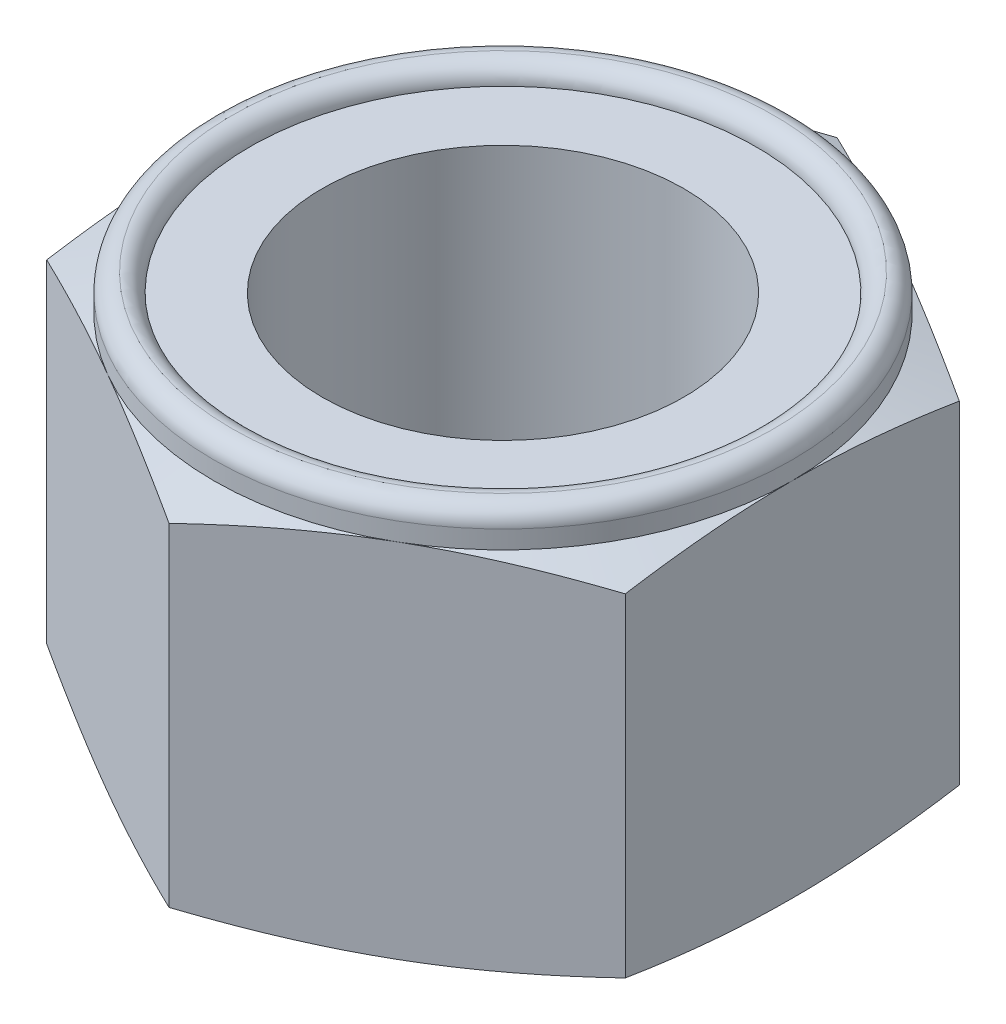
ISO-10303-21;
HEADER;
FILE_DESCRIPTION(('STEP AP214'),'2;1');
FILE_NAME('part.step','',(''),(''),'','','');
FILE_SCHEMA(('AUTOMOTIVE_DESIGN { 1 0 10303 214 1 1 1 1 }'));
ENDSEC;
DATA;
#1=APPLICATION_CONTEXT('core data for automotive mechanical design processes');
#2=APPLICATION_PROTOCOL_DEFINITION('international standard','automotive_design',2000,#1);
#3=PRODUCT_CONTEXT('',#1,'mechanical');
#4=PRODUCT('Part','Part','',(#3));
#5=PRODUCT_RELATED_PRODUCT_CATEGORY('part','',(#4));
#6=PRODUCT_DEFINITION_FORMATION('','',#4);
#7=PRODUCT_DEFINITION_CONTEXT('part definition',#1,'design');
#8=PRODUCT_DEFINITION('design','',#6,#7);
#9=PRODUCT_DEFINITION_SHAPE('','',#8);
#10=(LENGTH_UNIT() NAMED_UNIT(*) SI_UNIT(.MILLI.,.METRE.));
#11=(NAMED_UNIT(*) PLANE_ANGLE_UNIT() SI_UNIT($,.RADIAN.));
#12=(NAMED_UNIT(*) SI_UNIT($,.STERADIAN.) SOLID_ANGLE_UNIT());
#13=UNCERTAINTY_MEASURE_WITH_UNIT(LENGTH_MEASURE(1.E-05),#10,'distance_accuracy_value','');
#14=(GEOMETRIC_REPRESENTATION_CONTEXT(3) GLOBAL_UNCERTAINTY_ASSIGNED_CONTEXT((#13)) GLOBAL_UNIT_ASSIGNED_CONTEXT((#10,
#11,#12)) REPRESENTATION_CONTEXT('',''));
#15=CARTESIAN_POINT('',(0.,0.,0.));
#16=DIRECTION('',(0.,0.,1.));
#17=DIRECTION('',(1.,0.,0.));
#18=AXIS2_PLACEMENT_3D('',#15,#16,#17);
#19=CARTESIAN_POINT('',(0.,0.,0.));
#20=DIRECTION('',(0.,1.,0.));
#21=DIRECTION('',(0.,0.,1.));
#22=AXIS2_PLACEMENT_3D('',#19,#20,#21);
#23=CYLINDRICAL_SURFACE('',#22,3.96875);
#24=CARTESIAN_POINT('',(0.,0.,0.));
#25=DIRECTION('',(0.,1.,0.));
#26=DIRECTION('',(0.,0.,1.));
#27=AXIS2_PLACEMENT_3D('',#24,#25,#26);
#28=CIRCLE('',#27,3.96875);
#29=CARTESIAN_POINT('',(0.,0.,3.96875));
#30=VERTEX_POINT('',#29);
#31=EDGE_CURVE('E256',#30,#30,#28,.T.);
#32=ORIENTED_EDGE('',*,*,#31,.F.);
#33=EDGE_LOOP('',(#32));
#34=FACE_BOUND('',#33,.T.);
#35=CARTESIAN_POINT('',(0.,8.334375,0.));
#36=DIRECTION('',(0.,1.,0.));
#37=DIRECTION('',(0.,0.,1.));
#38=AXIS2_PLACEMENT_3D('',#35,#36,#37);
#39=CIRCLE('',#38,3.96875);
#40=CARTESIAN_POINT('',(0.,8.334375,3.96875));
#41=VERTEX_POINT('',#40);
#42=EDGE_CURVE('E166',#41,#41,#39,.F.);
#43=ORIENTED_EDGE('',*,*,#42,.F.);
#44=EDGE_LOOP('',(#43));
#45=FACE_BOUND('',#44,.T.);
#46=ADVANCED_FACE('F34',(#34,#45),#23,.F.);
#47=CARTESIAN_POINT('',(6.35,7.9375,-3.66617420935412));
#48=DIRECTION('',(-0.5,0.,0.866025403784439));
#49=DIRECTION('',(0.866025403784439,0.,0.5));
#50=AXIS2_PLACEMENT_3D('',#47,#48,#49);
#51=PLANE('',#50);
#52=CARTESIAN_POINT('',(-0.000199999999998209,0.317537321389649,-7.33246388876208));
#53=CARTESIAN_POINT('',(0.263120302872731,0.26838143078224,-7.18043584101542));
#54=CARTESIAN_POINT('',(0.527129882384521,0.223707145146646,-7.02800983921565));
#55=CARTESIAN_POINT('',(1.05650402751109,0.145159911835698,-6.7223755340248));
#56=CARTESIAN_POINT('',(1.3218693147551,0.111293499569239,-6.56916681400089));
#57=CARTESIAN_POINT('',(1.85162405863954,0.0564698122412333,-6.26331277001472));
#58=CARTESIAN_POINT('',(2.11600596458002,0.0354178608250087,-6.11067180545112));
#59=CARTESIAN_POINT('',(2.6452586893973,0.00718496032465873,-5.80510760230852));
#60=CARTESIAN_POINT('',(2.91012934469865,0.,-5.65218445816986));
#61=CARTESIAN_POINT('',(3.43987065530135,0.,-5.34633816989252));
#62=CARTESIAN_POINT('',(3.7047413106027,0.00718496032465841,-5.19341502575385));
#63=CARTESIAN_POINT('',(4.23399403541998,0.0354178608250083,-4.88785082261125));
#64=CARTESIAN_POINT('',(4.49837594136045,0.0564698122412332,-4.73520985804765));
#65=CARTESIAN_POINT('',(5.0281306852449,0.111293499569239,-4.42935581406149));
#66=CARTESIAN_POINT('',(5.29349597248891,0.145159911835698,-4.27614709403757));
#67=CARTESIAN_POINT('',(5.82287011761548,0.223707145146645,-3.97051278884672));
#68=CARTESIAN_POINT('',(6.08687969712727,0.26838143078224,-3.81808678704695));
#69=CARTESIAN_POINT('',(6.3502,0.317537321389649,-3.66605873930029));
#70=B_SPLINE_CURVE_WITH_KNOTS('',3,(#52,#53,#54,#55,#56,#57,#58,#59,#60,#61,#62,#63,#64,#65,#66,
#67,#68,#69),.UNSPECIFIED.,.F.,.F.,(4,2,2,2,2,2,2,2,4),(0.,0.924084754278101,1.84872723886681,
2.76645258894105,3.68391243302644,4.60137227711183,5.51909762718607,6.44374011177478,
7.36782486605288),.UNSPECIFIED.);
#71=CARTESIAN_POINT('',(0.,0.3175,-7.33234841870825));
#72=VERTEX_POINT('',#71);
#73=CARTESIAN_POINT('',(3.175,0.,-5.49926131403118));
#74=VERTEX_POINT('',#73);
#75=EDGE_CURVE('E126',#72,#74,#70,.T.);
#76=ORIENTED_EDGE('',*,*,#75,.F.);
#77=DIRECTION('',(0.,-1.,0.));
#78=VECTOR('',#77,1.);
#79=CARTESIAN_POINT('',(0.,7.9375,-7.33234841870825));
#80=LINE('',#79,#78);
#81=CARTESIAN_POINT('',(0.,7.62,-7.33234841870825));
#82=VERTEX_POINT('',#81);
#83=EDGE_CURVE('E140',#82,#72,#80,.T.);
#84=ORIENTED_EDGE('',*,*,#83,.F.);
#85=CARTESIAN_POINT('',(6.3502,7.61996267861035,-3.66605873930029));
#86=CARTESIAN_POINT('',(6.08687969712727,7.66911856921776,-3.81808678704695));
#87=CARTESIAN_POINT('',(5.82287011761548,7.71379285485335,-3.97051278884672));
#88=CARTESIAN_POINT('',(5.29349597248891,7.7923400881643,-4.27614709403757));
#89=CARTESIAN_POINT('',(5.0281306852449,7.82620650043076,-4.42935581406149));
#90=CARTESIAN_POINT('',(4.49837594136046,7.88103018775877,-4.73520985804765));
#91=CARTESIAN_POINT('',(4.23399403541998,7.90208213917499,-4.88785082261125));
#92=CARTESIAN_POINT('',(3.70474131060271,7.93031503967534,-5.19341502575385));
#93=CARTESIAN_POINT('',(3.43987065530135,7.9375,-5.34633816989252));
#94=CARTESIAN_POINT('',(2.91012934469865,7.9375,-5.65218445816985));
#95=CARTESIAN_POINT('',(2.6452586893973,7.93031503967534,-5.80510760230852));
#96=CARTESIAN_POINT('',(2.11600596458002,7.90208213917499,-6.11067180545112));
#97=CARTESIAN_POINT('',(1.85162405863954,7.88103018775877,-6.26331277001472));
#98=CARTESIAN_POINT('',(1.3218693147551,7.82620650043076,-6.56916681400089));
#99=CARTESIAN_POINT('',(1.05650402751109,7.7923400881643,-6.7223755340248));
#100=CARTESIAN_POINT('',(0.527129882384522,7.71379285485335,-7.02800983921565));
#101=CARTESIAN_POINT('',(0.263120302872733,7.66911856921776,-7.18043584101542));
#102=CARTESIAN_POINT('',(-0.000199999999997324,7.61996267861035,-7.33246388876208));
#103=B_SPLINE_CURVE_WITH_KNOTS('',3,(#85,#86,#87,#88,#89,#90,#91,#92,#93,#94,#95,#96,#97,#98,
#99,#100,#101,#102),.UNSPECIFIED.,.F.,.F.,(4,2,2,2,2,2,2,2,4),(0.,0.9240847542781,
1.84872723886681,2.76645258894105,3.68391243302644,4.60137227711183,5.51909762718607,
6.44374011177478,7.36782486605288),.UNSPECIFIED.);
#104=CARTESIAN_POINT('',(3.175,7.9375,-5.49926131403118));
#105=VERTEX_POINT('',#104);
#106=EDGE_CURVE('E244',#105,#82,#103,.T.);
#107=ORIENTED_EDGE('',*,*,#106,.F.);
#108=CARTESIAN_POINT('',(6.35,7.62,-3.66617420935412));
#109=VERTEX_POINT('',#108);
#110=EDGE_CURVE('E250',#109,#105,#103,.T.);
#111=ORIENTED_EDGE('',*,*,#110,.F.);
#112=DIRECTION('',(0.,-1.,0.));
#113=VECTOR('',#112,1.);
#114=CARTESIAN_POINT('',(6.35,7.9375,-3.66617420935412));
#115=LINE('',#114,#113);
#116=CARTESIAN_POINT('',(6.35,0.3175,-3.66617420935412));
#117=VERTEX_POINT('',#116);
#118=EDGE_CURVE('E259',#109,#117,#115,.T.);
#119=ORIENTED_EDGE('',*,*,#118,.T.);
#120=EDGE_CURVE('E142',#74,#117,#70,.T.);
#121=ORIENTED_EDGE('',*,*,#120,.F.);
#122=EDGE_LOOP('',(#76,#84,#107,#111,#119,#121));
#123=FACE_BOUND('',#122,.T.);
#124=ADVANCED_FACE('F138',(#123),#51,.F.);
#125=CARTESIAN_POINT('',(0.,7.9375,-7.33234841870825));
#126=DIRECTION('',(0.5,0.,0.866025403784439));
#127=DIRECTION('',(0.866025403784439,0.,-0.5));
#128=AXIS2_PLACEMENT_3D('',#125,#126,#127);
#129=PLANE('',#128);
#130=CARTESIAN_POINT('',(-6.3502,0.31753732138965,-3.66605873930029));
#131=CARTESIAN_POINT('',(-6.08687969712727,0.268381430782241,-3.81808678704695));
#132=CARTESIAN_POINT('',(-5.82287011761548,0.223707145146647,-3.97051278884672));
#133=CARTESIAN_POINT('',(-5.29349597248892,0.145159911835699,-4.27614709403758));
#134=CARTESIAN_POINT('',(-5.0281306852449,0.111293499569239,-4.42935581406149));
#135=CARTESIAN_POINT('',(-4.49837594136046,0.0564698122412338,-4.73520985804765));
#136=CARTESIAN_POINT('',(-4.23399403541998,0.0354178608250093,-4.88785082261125));
#137=CARTESIAN_POINT('',(-3.7047413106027,0.00718496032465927,-5.19341502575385));
#138=CARTESIAN_POINT('',(-3.43987065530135,0.,-5.34633816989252));
#139=CARTESIAN_POINT('',(-2.91012934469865,0.,-5.65218445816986));
#140=CARTESIAN_POINT('',(-2.64525868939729,0.00718496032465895,-5.80510760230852));
#141=CARTESIAN_POINT('',(-2.11600596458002,0.0354178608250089,-6.11067180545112));
#142=CARTESIAN_POINT('',(-1.85162405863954,0.0564698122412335,-6.26331277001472));
#143=CARTESIAN_POINT('',(-1.3218693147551,0.111293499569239,-6.56916681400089));
#144=CARTESIAN_POINT('',(-1.05650402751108,0.145159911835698,-6.7223755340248));
#145=CARTESIAN_POINT('',(-0.527129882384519,0.223707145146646,-7.02800983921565));
#146=CARTESIAN_POINT('',(-0.263120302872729,0.26838143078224,-7.18043584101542));
#147=CARTESIAN_POINT('',(0.000200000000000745,0.317537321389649,-7.33246388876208));
#148=B_SPLINE_CURVE_WITH_KNOTS('',3,(#130,#131,#132,#133,#134,#135,#136,#137,#138,#139,#140,
#141,#142,#143,#144,#145,#146,#147),.UNSPECIFIED.,.F.,.F.,(4,2,2,2,2,2,2,2,4),(0.,
0.9240847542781,1.84872723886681,2.76645258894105,3.68391243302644,4.60137227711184,
5.51909762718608,6.44374011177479,7.36782486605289),.UNSPECIFIED.);
#149=CARTESIAN_POINT('',(-6.35,0.3175,-3.66617420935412));
#150=VERTEX_POINT('',#149);
#151=CARTESIAN_POINT('',(-3.175,0.,-5.49926131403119));
#152=VERTEX_POINT('',#151);
#153=EDGE_CURVE('E132',#150,#152,#148,.T.);
#154=ORIENTED_EDGE('',*,*,#153,.F.);
#155=DIRECTION('',(0.,-1.,0.));
#156=VECTOR('',#155,1.);
#157=CARTESIAN_POINT('',(-6.35,7.9375,-3.66617420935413));
#158=LINE('',#157,#156);
#159=CARTESIAN_POINT('',(-6.35,7.62,-3.66617420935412));
#160=VERTEX_POINT('',#159);
#161=EDGE_CURVE('E151',#160,#150,#158,.T.);
#162=ORIENTED_EDGE('',*,*,#161,.F.);
#163=CARTESIAN_POINT('',(0.000200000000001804,7.61996267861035,-7.33246388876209));
#164=CARTESIAN_POINT('',(-0.263120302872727,7.66911856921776,-7.18043584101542));
#165=CARTESIAN_POINT('',(-0.527129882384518,7.71379285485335,-7.02800983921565));
#166=CARTESIAN_POINT('',(-1.05650402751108,7.7923400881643,-6.7223755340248));
#167=CARTESIAN_POINT('',(-1.3218693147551,7.82620650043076,-6.56916681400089));
#168=CARTESIAN_POINT('',(-1.85162405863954,7.88103018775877,-6.26331277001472));
#169=CARTESIAN_POINT('',(-2.11600596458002,7.90208213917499,-6.11067180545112));
#170=CARTESIAN_POINT('',(-2.64525868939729,7.93031503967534,-5.80510760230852));
#171=CARTESIAN_POINT('',(-2.91012934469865,7.9375,-5.65218445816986));
#172=CARTESIAN_POINT('',(-3.43987065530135,7.9375,-5.34633816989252));
#173=CARTESIAN_POINT('',(-3.7047413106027,7.93031503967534,-5.19341502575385));
#174=CARTESIAN_POINT('',(-4.23399403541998,7.90208213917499,-4.88785082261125));
#175=CARTESIAN_POINT('',(-4.49837594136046,7.88103018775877,-4.73520985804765));
#176=CARTESIAN_POINT('',(-5.0281306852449,7.82620650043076,-4.42935581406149));
#177=CARTESIAN_POINT('',(-5.29349597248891,7.7923400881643,-4.27614709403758));
#178=CARTESIAN_POINT('',(-5.82287011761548,7.71379285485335,-3.97051278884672));
#179=CARTESIAN_POINT('',(-6.08687969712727,7.66911856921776,-3.81808678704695));
#180=CARTESIAN_POINT('',(-6.3502,7.61996267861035,-3.66605873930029));
#181=B_SPLINE_CURVE_WITH_KNOTS('',3,(#163,#164,#165,#166,#167,#168,#169,#170,#171,#172,#173,
#174,#175,#176,#177,#178,#179,#180),.UNSPECIFIED.,.F.,.F.,(4,2,2,2,2,2,2,2,4),(0.,
0.9240847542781,1.84872723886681,2.76645258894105,3.68391243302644,4.60137227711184,
5.51909762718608,6.44374011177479,7.36782486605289),.UNSPECIFIED.);
#182=CARTESIAN_POINT('',(-3.175,7.9375,-5.49926131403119));
#183=VERTEX_POINT('',#182);
#184=EDGE_CURVE('E251',#183,#160,#181,.T.);
#185=ORIENTED_EDGE('',*,*,#184,.F.);
#186=EDGE_CURVE('E149',#82,#183,#181,.T.);
#187=ORIENTED_EDGE('',*,*,#186,.F.);
#188=ORIENTED_EDGE('',*,*,#83,.T.);
#189=EDGE_CURVE('E123',#152,#72,#148,.T.);
#190=ORIENTED_EDGE('',*,*,#189,.F.);
#191=EDGE_LOOP('',(#154,#162,#185,#187,#188,#190));
#192=FACE_BOUND('',#191,.T.);
#193=ADVANCED_FACE('F146',(#192),#129,.F.);
#194=CARTESIAN_POINT('',(-6.35,7.9375,-3.66617420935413));
#195=DIRECTION('',(1.,0.,0.));
#196=DIRECTION('',(0.,0.,-1.));
#197=AXIS2_PLACEMENT_3D('',#194,#195,#196);
#198=PLANE('',#197);
#199=CARTESIAN_POINT('',(-6.35,1.69502401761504,-9.70093472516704));
#200=CARTESIAN_POINT('',(-6.35,1.6172083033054,-9.41309925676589));
#201=CARTESIAN_POINT('',(-6.35,1.54032127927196,-9.12500808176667));
#202=CARTESIAN_POINT('',(-6.35,1.38891335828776,-8.54818641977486));
#203=CARTESIAN_POINT('',(-6.35,1.31439260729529,-8.25945589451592));
#204=CARTESIAN_POINT('',(-6.35,1.16813099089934,-7.68084887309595));
#205=CARTESIAN_POINT('',(-6.35,1.09639426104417,-7.39097132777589));
#206=CARTESIAN_POINT('',(-6.35,0.956510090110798,-6.81035199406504));
#207=CARTESIAN_POINT('',(-6.35,0.888362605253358,-6.5196102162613));
#208=CARTESIAN_POINT('',(-6.35,0.757298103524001,-5.9404984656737));
#209=CARTESIAN_POINT('',(-6.35,0.694329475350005,-5.65214023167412));
#210=CARTESIAN_POINT('',(-6.35,0.573820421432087,-5.07429372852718));
#211=CARTESIAN_POINT('',(-6.35,0.516279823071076,-4.78480549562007));
#212=CARTESIAN_POINT('',(-6.35,0.407941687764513,-4.20461255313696));
#213=CARTESIAN_POINT('',(-6.35,0.357142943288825,-3.91390807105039));
#214=CARTESIAN_POINT('',(-6.35,0.26381533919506,-3.33115912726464));
#215=CARTESIAN_POINT('',(-6.35,0.221286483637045,-3.03911466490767));
#216=CARTESIAN_POINT('',(-6.35,0.146011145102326,-2.45238761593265));
#217=CARTESIAN_POINT('',(-6.35,0.113310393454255,-2.15769907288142));
#218=CARTESIAN_POINT('',(-6.35,0.0596044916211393,-1.56724907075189));
#219=CARTESIAN_POINT('',(-6.35,0.0385989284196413,-1.27148764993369));
#220=CARTESIAN_POINT('',(-6.35,0.00955386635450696,-0.679517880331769));
#221=CARTESIAN_POINT('',(-6.35,0.00150552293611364,-0.383309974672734));
#222=CARTESIAN_POINT('',(-6.35,-0.00111965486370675,0.20916642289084));
#223=CARTESIAN_POINT('',(-6.35,0.00430349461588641,0.505434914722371));
#224=CARTESIAN_POINT('',(-6.35,0.0283211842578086,1.09896407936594));
#225=CARTESIAN_POINT('',(-6.35,0.0469838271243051,1.39622193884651));
#226=CARTESIAN_POINT('',(-6.35,0.0963948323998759,1.98972229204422));
#227=CARTESIAN_POINT('',(-6.35,0.127143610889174,2.2859647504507));
#228=CARTESIAN_POINT('',(-6.35,0.199137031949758,2.87744733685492));
#229=CARTESIAN_POINT('',(-6.35,0.240391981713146,3.17268619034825));
#230=CARTESIAN_POINT('',(-6.35,0.331637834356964,3.76179532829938));
#231=CARTESIAN_POINT('',(-6.35,0.381628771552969,4.05566560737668));
#232=CARTESIAN_POINT('',(-6.35,0.485241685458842,4.62301223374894));
#233=CARTESIAN_POINT('',(-6.35,0.538415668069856,4.89657123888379));
#234=CARTESIAN_POINT('',(-6.35,0.649846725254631,5.44265707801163));
#235=CARTESIAN_POINT('',(-6.35,0.708103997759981,5.71518387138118));
#236=CARTESIAN_POINT('',(-6.35,0.828758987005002,6.2593512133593));
#237=CARTESIAN_POINT('',(-6.35,0.891157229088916,6.53099164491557));
#238=CARTESIAN_POINT('',(-6.35,1.01932758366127,7.07347732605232));
#239=CARTESIAN_POINT('',(-6.35,1.08509975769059,7.34432256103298));
#240=CARTESIAN_POINT('',(-6.35,1.28655829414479,8.1559856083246));
#241=CARTESIAN_POINT('',(-6.35,1.42635306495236,8.69578260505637));
#242=CARTESIAN_POINT('',(-6.35,1.71334041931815,9.77333754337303));
#243=CARTESIAN_POINT('',(-6.35,1.86053238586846,10.3110956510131));
#244=CARTESIAN_POINT('',(-6.35,2.15805193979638,11.3777265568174));
#245=CARTESIAN_POINT('',(-6.35,2.30830798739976,11.9066193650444));
#246=CARTESIAN_POINT('',(-6.35,2.61249078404,12.9633599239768));
#247=CARTESIAN_POINT('',(-6.35,2.76641762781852,13.4912076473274));
#248=CARTESIAN_POINT('',(-6.35,3.07672310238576,14.5452125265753));
#249=CARTESIAN_POINT('',(-6.35,3.23309715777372,15.0713710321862));
#250=CARTESIAN_POINT('',(-6.35,3.54793125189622,16.1230375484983));
#251=CARTESIAN_POINT('',(-6.35,3.70639119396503,16.6485455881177));
#252=CARTESIAN_POINT('',(-6.35,3.86559200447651,17.1738263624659));
#253=B_SPLINE_CURVE_WITH_KNOTS('',3,(#199,#200,#201,#202,#203,#204,#205,#206,#207,#208,#209,
#210,#211,#212,#213,#214,#215,#216,#217,#218,#219,#220,#221,#222,#223,#224,#225,#226,#227,#228,
#229,#230,#231,#232,#233,#234,#235,#236,#237,#238,#239,#240,#241,#242,#243,#244,#245,#246,#247,
#248,#249,#250,#251,#252),.UNSPECIFIED.,.F.,.F.,(4,2,2,2,2,2,2,2,2,2,2,2,2,2,2,2,2,2,2,2,2,2,2,
2,2,2,4),(0.,0.894511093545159,1.78907725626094,2.68492501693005,3.5807618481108,
4.46618049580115,5.35157097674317,6.23680266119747,7.12203478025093,8.01132439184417,
8.90058259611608,9.78923353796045,10.6778834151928,11.5711378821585,12.464423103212,
13.3585880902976,14.2527565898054,15.0887366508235,15.9247492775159,16.7608681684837,
17.5970023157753,19.2697262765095,20.9423109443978,22.5917589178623,24.2412495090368,
25.8879567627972,27.5345879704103),.UNSPECIFIED.);
#254=CARTESIAN_POINT('',(-6.35,0.3175,3.66617420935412));
#255=VERTEX_POINT('',#254);
#256=CARTESIAN_POINT('',(-6.35,0.,0.));
#257=VERTEX_POINT('',#256);
#258=EDGE_CURVE('E280',#255,#257,#253,.F.);
#259=ORIENTED_EDGE('',*,*,#258,.F.);
#260=DIRECTION('',(0.,-1.,0.));
#261=VECTOR('',#260,1.);
#262=CARTESIAN_POINT('',(-6.35,7.9375,3.66617420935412));
#263=LINE('',#262,#261);
#264=CARTESIAN_POINT('',(-6.35,7.62,3.66617420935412));
#265=VERTEX_POINT('',#264);
#266=EDGE_CURVE('E158',#265,#255,#263,.T.);
#267=ORIENTED_EDGE('',*,*,#266,.F.);
#268=CARTESIAN_POINT('',(-6.35,6.24247598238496,-9.70093472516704));
#269=CARTESIAN_POINT('',(-6.35,6.3202916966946,-9.41309925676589));
#270=CARTESIAN_POINT('',(-6.35,6.39717872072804,-9.12500808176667));
#271=CARTESIAN_POINT('',(-6.35,6.54858664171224,-8.54818641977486));
#272=CARTESIAN_POINT('',(-6.35,6.62310739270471,-8.25945589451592));
#273=CARTESIAN_POINT('',(-6.35,6.76936900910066,-7.68084887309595));
#274=CARTESIAN_POINT('',(-6.35,6.84110573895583,-7.39097132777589));
#275=CARTESIAN_POINT('',(-6.35,6.9809899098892,-6.81035199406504));
#276=CARTESIAN_POINT('',(-6.35,7.04913739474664,-6.5196102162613));
#277=CARTESIAN_POINT('',(-6.35,7.180201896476,-5.9404984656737));
#278=CARTESIAN_POINT('',(-6.35,7.24317052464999,-5.65214023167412));
#279=CARTESIAN_POINT('',(-6.35,7.36367957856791,-5.07429372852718));
#280=CARTESIAN_POINT('',(-6.35,7.42122017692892,-4.78480549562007));
#281=CARTESIAN_POINT('',(-6.35,7.52955831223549,-4.20461255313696));
#282=CARTESIAN_POINT('',(-6.35,7.58035705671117,-3.91390807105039));
#283=CARTESIAN_POINT('',(-6.35,7.67368466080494,-3.33115912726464));
#284=CARTESIAN_POINT('',(-6.35,7.71621351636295,-3.03911466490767));
#285=CARTESIAN_POINT('',(-6.35,7.79148885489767,-2.45238761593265));
#286=CARTESIAN_POINT('',(-6.35,7.82418960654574,-2.15769907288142));
#287=CARTESIAN_POINT('',(-6.35,7.87789550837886,-1.56724907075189));
#288=CARTESIAN_POINT('',(-6.35,7.89890107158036,-1.27148764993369));
#289=CARTESIAN_POINT('',(-6.35,7.92794613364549,-0.679517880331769));
#290=CARTESIAN_POINT('',(-6.35,7.93599447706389,-0.383309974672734));
#291=CARTESIAN_POINT('',(-6.35,7.93861965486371,0.20916642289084));
#292=CARTESIAN_POINT('',(-6.35,7.93319650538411,0.505434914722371));
#293=CARTESIAN_POINT('',(-6.35,7.90917881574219,1.09896407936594));
#294=CARTESIAN_POINT('',(-6.35,7.8905161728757,1.39622193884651));
#295=CARTESIAN_POINT('',(-6.35,7.84110516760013,1.98972229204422));
#296=CARTESIAN_POINT('',(-6.35,7.81035638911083,2.2859647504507));
#297=CARTESIAN_POINT('',(-6.35,7.73836296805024,2.87744733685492));
#298=CARTESIAN_POINT('',(-6.35,7.69710801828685,3.17268619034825));
#299=CARTESIAN_POINT('',(-6.35,7.60586216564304,3.76179532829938));
#300=CARTESIAN_POINT('',(-6.35,7.55587122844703,4.05566560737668));
#301=CARTESIAN_POINT('',(-6.35,7.45225831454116,4.62301223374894));
#302=CARTESIAN_POINT('',(-6.35,7.39908433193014,4.89657123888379));
#303=CARTESIAN_POINT('',(-6.35,7.28765327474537,5.44265707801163));
#304=CARTESIAN_POINT('',(-6.35,7.22939600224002,5.71518387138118));
#305=CARTESIAN_POINT('',(-6.35,7.108741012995,6.2593512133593));
#306=CARTESIAN_POINT('',(-6.35,7.04634277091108,6.53099164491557));
#307=CARTESIAN_POINT('',(-6.35,6.91817241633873,7.07347732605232));
#308=CARTESIAN_POINT('',(-6.35,6.85240024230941,7.34432256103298));
#309=CARTESIAN_POINT('',(-6.35,6.65094170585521,8.1559856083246));
#310=CARTESIAN_POINT('',(-6.35,6.51114693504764,8.69578260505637));
#311=CARTESIAN_POINT('',(-6.35,6.22415958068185,9.77333754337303));
#312=CARTESIAN_POINT('',(-6.35,6.07696761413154,10.3110956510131));
#313=CARTESIAN_POINT('',(-6.35,5.77944806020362,11.3777265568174));
#314=CARTESIAN_POINT('',(-6.35,5.62919201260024,11.9066193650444));
#315=CARTESIAN_POINT('',(-6.35,5.32500921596,12.9633599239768));
#316=CARTESIAN_POINT('',(-6.35,5.17108237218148,13.4912076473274));
#317=CARTESIAN_POINT('',(-6.35,4.86077689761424,14.5452125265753));
#318=CARTESIAN_POINT('',(-6.35,4.70440284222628,15.0713710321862));
#319=CARTESIAN_POINT('',(-6.35,4.38956874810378,16.1230375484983));
#320=CARTESIAN_POINT('',(-6.35,4.23110880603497,16.6485455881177));
#321=CARTESIAN_POINT('',(-6.35,4.07190799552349,17.1738263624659));
#322=B_SPLINE_CURVE_WITH_KNOTS('',3,(#268,#269,#270,#271,#272,#273,#274,#275,#276,#277,#278,
#279,#280,#281,#282,#283,#284,#285,#286,#287,#288,#289,#290,#291,#292,#293,#294,#295,#296,#297,
#298,#299,#300,#301,#302,#303,#304,#305,#306,#307,#308,#309,#310,#311,#312,#313,#314,#315,#316,
#317,#318,#319,#320,#321),.UNSPECIFIED.,.F.,.F.,(4,2,2,2,2,2,2,2,2,2,2,2,2,2,2,2,2,2,2,2,2,2,2,
2,2,2,4),(0.,0.894511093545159,1.78907725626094,2.68492501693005,3.5807618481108,
4.46618049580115,5.35157097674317,6.23680266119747,7.12203478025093,8.01132439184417,
8.90058259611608,9.78923353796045,10.6778834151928,11.5711378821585,12.464423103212,
13.3585880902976,14.2527565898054,15.0887366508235,15.9247492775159,16.7608681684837,
17.5970023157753,19.2697262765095,20.9423109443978,22.5917589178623,24.2412495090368,
25.8879567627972,27.5345879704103),.UNSPECIFIED.);
#323=CARTESIAN_POINT('',(-6.35,7.9375,0.));
#324=VERTEX_POINT('',#323);
#325=EDGE_CURVE('E279',#324,#265,#322,.T.);
#326=ORIENTED_EDGE('',*,*,#325,.F.);
#327=EDGE_CURVE('E321',#160,#324,#322,.T.);
#328=ORIENTED_EDGE('',*,*,#327,.F.);
#329=ORIENTED_EDGE('',*,*,#161,.T.);
#330=EDGE_CURVE('E185',#257,#150,#253,.F.);
#331=ORIENTED_EDGE('',*,*,#330,.F.);
#332=EDGE_LOOP('',(#259,#267,#326,#328,#329,#331));
#333=FACE_BOUND('',#332,.T.);
#334=ADVANCED_FACE('F277',(#333),#198,.F.);
#335=CARTESIAN_POINT('',(-6.35,7.9375,3.66617420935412));
#336=DIRECTION('',(0.5,0.,-0.866025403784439));
#337=DIRECTION('',(-0.866025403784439,0.,-0.5));
#338=AXIS2_PLACEMENT_3D('',#335,#336,#337);
#339=PLANE('',#338);
#340=CARTESIAN_POINT('',(0.000199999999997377,0.317537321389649,7.33246388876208));
#341=CARTESIAN_POINT('',(-0.263120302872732,0.26838143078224,7.18043584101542));
#342=CARTESIAN_POINT('',(-0.527129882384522,0.223707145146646,7.02800983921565));
#343=CARTESIAN_POINT('',(-1.05650402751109,0.145159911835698,6.7223755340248));
#344=CARTESIAN_POINT('',(-1.3218693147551,0.111293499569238,6.56916681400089));
#345=CARTESIAN_POINT('',(-1.85162405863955,0.056469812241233,6.26331277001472));
#346=CARTESIAN_POINT('',(-2.11600596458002,0.0354178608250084,6.11067180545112));
#347=CARTESIAN_POINT('',(-2.6452586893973,0.00718496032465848,5.80510760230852));
#348=CARTESIAN_POINT('',(-2.91012934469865,0.,5.65218445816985));
#349=CARTESIAN_POINT('',(-3.43987065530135,0.,5.34633816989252));
#350=CARTESIAN_POINT('',(-3.70474131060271,0.00718496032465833,5.19341502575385));
#351=CARTESIAN_POINT('',(-4.23399403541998,0.0354178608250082,4.88785082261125));
#352=CARTESIAN_POINT('',(-4.49837594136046,0.0564698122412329,4.73520985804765));
#353=CARTESIAN_POINT('',(-5.0281306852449,0.111293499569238,4.42935581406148));
#354=CARTESIAN_POINT('',(-5.29349597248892,0.145159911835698,4.27614709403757));
#355=CARTESIAN_POINT('',(-5.82287011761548,0.223707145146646,3.97051278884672));
#356=CARTESIAN_POINT('',(-6.08687969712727,0.26838143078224,3.81808678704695));
#357=CARTESIAN_POINT('',(-6.3502,0.317537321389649,3.66605873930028));
#358=B_SPLINE_CURVE_WITH_KNOTS('',3,(#340,#341,#342,#343,#344,#345,#346,#347,#348,#349,#350,
#351,#352,#353,#354,#355,#356,#357),.UNSPECIFIED.,.F.,.F.,(4,2,2,2,2,2,2,2,4),(0.,
0.9240847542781,1.84872723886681,2.76645258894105,3.68391243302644,4.60137227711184,
5.51909762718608,6.44374011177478,7.36782486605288),.UNSPECIFIED.);
#359=CARTESIAN_POINT('',(0.,0.3175,7.33234841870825));
#360=VERTEX_POINT('',#359);
#361=CARTESIAN_POINT('',(-3.175,0.,5.49926131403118));
#362=VERTEX_POINT('',#361);
#363=EDGE_CURVE('E133',#360,#362,#358,.T.);
#364=ORIENTED_EDGE('',*,*,#363,.F.);
#365=DIRECTION('',(0.,-1.,0.));
#366=VECTOR('',#365,1.);
#367=CARTESIAN_POINT('',(0.,7.9375,7.33234841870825));
#368=LINE('',#367,#366);
#369=CARTESIAN_POINT('',(0.,7.62,7.33234841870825));
#370=VERTEX_POINT('',#369);
#371=EDGE_CURVE('E264',#370,#360,#368,.T.);
#372=ORIENTED_EDGE('',*,*,#371,.F.);
#373=CARTESIAN_POINT('',(-6.3502,7.61996267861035,3.66605873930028));
#374=CARTESIAN_POINT('',(-6.08687969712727,7.66911856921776,3.81808678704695));
#375=CARTESIAN_POINT('',(-5.82287011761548,7.71379285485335,3.97051278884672));
#376=CARTESIAN_POINT('',(-5.29349597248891,7.7923400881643,4.27614709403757));
#377=CARTESIAN_POINT('',(-5.0281306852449,7.82620650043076,4.42935581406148));
#378=CARTESIAN_POINT('',(-4.49837594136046,7.88103018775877,4.73520985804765));
#379=CARTESIAN_POINT('',(-4.23399403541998,7.90208213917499,4.88785082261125));
#380=CARTESIAN_POINT('',(-3.70474131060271,7.93031503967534,5.19341502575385));
#381=CARTESIAN_POINT('',(-3.43987065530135,7.9375,5.34633816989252));
#382=CARTESIAN_POINT('',(-2.91012934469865,7.9375,5.65218445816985));
#383=CARTESIAN_POINT('',(-2.6452586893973,7.93031503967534,5.80510760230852));
#384=CARTESIAN_POINT('',(-2.11600596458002,7.90208213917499,6.11067180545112));
#385=CARTESIAN_POINT('',(-1.85162405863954,7.88103018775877,6.26331277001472));
#386=CARTESIAN_POINT('',(-1.3218693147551,7.82620650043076,6.56916681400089));
#387=CARTESIAN_POINT('',(-1.05650402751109,7.7923400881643,6.7223755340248));
#388=CARTESIAN_POINT('',(-0.527129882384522,7.71379285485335,7.02800983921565));
#389=CARTESIAN_POINT('',(-0.263120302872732,7.66911856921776,7.18043584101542));
#390=CARTESIAN_POINT('',(0.000199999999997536,7.61996267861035,7.33246388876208));
#391=B_SPLINE_CURVE_WITH_KNOTS('',3,(#373,#374,#375,#376,#377,#378,#379,#380,#381,#382,#383,
#384,#385,#386,#387,#388,#389,#390),.UNSPECIFIED.,.F.,.F.,(4,2,2,2,2,2,2,2,4),(0.,
0.924084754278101,1.84872723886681,2.76645258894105,3.68391243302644,4.60137227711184,
5.51909762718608,6.44374011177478,7.36782486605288),.UNSPECIFIED.);
#392=CARTESIAN_POINT('',(-3.175,7.9375,5.49926131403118));
#393=VERTEX_POINT('',#392);
#394=EDGE_CURVE('E313',#393,#370,#391,.T.);
#395=ORIENTED_EDGE('',*,*,#394,.F.);
#396=EDGE_CURVE('E273',#265,#393,#391,.T.);
#397=ORIENTED_EDGE('',*,*,#396,.F.);
#398=ORIENTED_EDGE('',*,*,#266,.T.);
#399=EDGE_CURVE('E187',#362,#255,#358,.T.);
#400=ORIENTED_EDGE('',*,*,#399,.F.);
#401=EDGE_LOOP('',(#364,#372,#395,#397,#398,#400));
#402=FACE_BOUND('',#401,.T.);
#403=ADVANCED_FACE('F271',(#402),#339,.F.);
#404=CARTESIAN_POINT('',(0.,7.9375,7.33234841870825));
#405=DIRECTION('',(-0.5,0.,-0.866025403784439));
#406=DIRECTION('',(-0.866025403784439,0.,0.5));
#407=AXIS2_PLACEMENT_3D('',#404,#405,#406);
#408=PLANE('',#407);
#409=CARTESIAN_POINT('',(6.3502,0.317537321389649,3.66605873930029));
#410=CARTESIAN_POINT('',(6.08687969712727,0.26838143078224,3.81808678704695));
#411=CARTESIAN_POINT('',(5.82287011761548,0.223707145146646,3.97051278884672));
#412=CARTESIAN_POINT('',(5.29349597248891,0.145159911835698,4.27614709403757));
#413=CARTESIAN_POINT('',(5.0281306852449,0.111293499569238,4.42935581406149));
#414=CARTESIAN_POINT('',(4.49837594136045,0.0564698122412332,4.73520985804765));
#415=CARTESIAN_POINT('',(4.23399403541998,0.0354178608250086,4.88785082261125));
#416=CARTESIAN_POINT('',(3.7047413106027,0.00718496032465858,5.19341502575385));
#417=CARTESIAN_POINT('',(3.43987065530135,0.,5.34633816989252));
#418=CARTESIAN_POINT('',(2.91012934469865,0.,5.65218445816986));
#419=CARTESIAN_POINT('',(2.64525868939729,0.00718496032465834,5.80510760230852));
#420=CARTESIAN_POINT('',(2.11600596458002,0.0354178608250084,6.11067180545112));
#421=CARTESIAN_POINT('',(1.85162405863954,0.0564698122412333,6.26331277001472));
#422=CARTESIAN_POINT('',(1.32186931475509,0.111293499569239,6.56916681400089));
#423=CARTESIAN_POINT('',(1.05650402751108,0.145159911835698,6.7223755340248));
#424=CARTESIAN_POINT('',(0.527129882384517,0.223707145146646,7.02800983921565));
#425=CARTESIAN_POINT('',(0.263120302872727,0.26838143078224,7.18043584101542));
#426=CARTESIAN_POINT('',(-0.000200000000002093,0.317537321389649,7.33246388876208));
#427=B_SPLINE_CURVE_WITH_KNOTS('',3,(#409,#410,#411,#412,#413,#414,#415,#416,#417,#418,#419,
#420,#421,#422,#423,#424,#425,#426),.UNSPECIFIED.,.F.,.F.,(4,2,2,2,2,2,2,2,4),(0.,
0.924084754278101,1.84872723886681,2.76645258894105,3.68391243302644,4.60137227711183,
5.51909762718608,6.44374011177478,7.36782486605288),.UNSPECIFIED.);
#428=CARTESIAN_POINT('',(6.35,0.3175,3.66617420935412));
#429=VERTEX_POINT('',#428);
#430=CARTESIAN_POINT('',(3.175,0.,5.49926131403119));
#431=VERTEX_POINT('',#430);
#432=EDGE_CURVE('E230',#429,#431,#427,.T.);
#433=ORIENTED_EDGE('',*,*,#432,.F.);
#434=DIRECTION('',(0.,-1.,0.));
#435=VECTOR('',#434,1.);
#436=CARTESIAN_POINT('',(6.35,7.9375,3.66617420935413));
#437=LINE('',#436,#435);
#438=CARTESIAN_POINT('',(6.35,7.62,3.66617420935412));
#439=VERTEX_POINT('',#438);
#440=EDGE_CURVE('E261',#439,#429,#437,.T.);
#441=ORIENTED_EDGE('',*,*,#440,.F.);
#442=CARTESIAN_POINT('',(-0.000200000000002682,7.61996267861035,7.33246388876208));
#443=CARTESIAN_POINT('',(0.263120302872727,7.66911856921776,7.18043584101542));
#444=CARTESIAN_POINT('',(0.527129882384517,7.71379285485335,7.02800983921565));
#445=CARTESIAN_POINT('',(1.05650402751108,7.7923400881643,6.7223755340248));
#446=CARTESIAN_POINT('',(1.32186931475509,7.82620650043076,6.56916681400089));
#447=CARTESIAN_POINT('',(1.85162405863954,7.88103018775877,6.26331277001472));
#448=CARTESIAN_POINT('',(2.11600596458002,7.90208213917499,6.11067180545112));
#449=CARTESIAN_POINT('',(2.64525868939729,7.93031503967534,5.80510760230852));
#450=CARTESIAN_POINT('',(2.91012934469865,7.9375,5.65218445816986));
#451=CARTESIAN_POINT('',(3.43987065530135,7.9375,5.34633816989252));
#452=CARTESIAN_POINT('',(3.7047413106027,7.93031503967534,5.19341502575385));
#453=CARTESIAN_POINT('',(4.23399403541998,7.90208213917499,4.88785082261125));
#454=CARTESIAN_POINT('',(4.49837594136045,7.88103018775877,4.73520985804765));
#455=CARTESIAN_POINT('',(5.0281306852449,7.82620650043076,4.42935581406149));
#456=CARTESIAN_POINT('',(5.29349597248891,7.7923400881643,4.27614709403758));
#457=CARTESIAN_POINT('',(5.82287011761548,7.71379285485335,3.97051278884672));
#458=CARTESIAN_POINT('',(6.08687969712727,7.66911856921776,3.81808678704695));
#459=CARTESIAN_POINT('',(6.3502,7.61996267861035,3.66605873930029));
#460=B_SPLINE_CURVE_WITH_KNOTS('',3,(#442,#443,#444,#445,#446,#447,#448,#449,#450,#451,#452,
#453,#454,#455,#456,#457,#458,#459),.UNSPECIFIED.,.F.,.F.,(4,2,2,2,2,2,2,2,4),(0.,
0.924084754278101,1.84872723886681,2.76645258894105,3.68391243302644,4.60137227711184,
5.51909762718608,6.44374011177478,7.36782486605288),.UNSPECIFIED.);
#461=CARTESIAN_POINT('',(3.175,7.9375,5.49926131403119));
#462=VERTEX_POINT('',#461);
#463=EDGE_CURVE('E288',#462,#439,#460,.T.);
#464=ORIENTED_EDGE('',*,*,#463,.F.);
#465=EDGE_CURVE('E317',#370,#462,#460,.T.);
#466=ORIENTED_EDGE('',*,*,#465,.F.);
#467=ORIENTED_EDGE('',*,*,#371,.T.);
#468=EDGE_CURVE('E143',#431,#360,#427,.T.);
#469=ORIENTED_EDGE('',*,*,#468,.F.);
#470=EDGE_LOOP('',(#433,#441,#464,#466,#467,#469));
#471=FACE_BOUND('',#470,.T.);
#472=ADVANCED_FACE('F301',(#471),#408,.F.);
#473=CARTESIAN_POINT('',(6.35,7.9375,3.66617420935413));
#474=DIRECTION('',(-1.,0.,0.));
#475=DIRECTION('',(0.,0.,1.));
#476=AXIS2_PLACEMENT_3D('',#473,#474,#475);
#477=PLANE('',#476);
#478=CARTESIAN_POINT('',(6.35,1.69502376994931,-9.70093380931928));
#479=CARTESIAN_POINT('',(6.35,1.61720806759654,-9.41309837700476));
#480=CARTESIAN_POINT('',(6.35,1.54032105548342,-9.12500723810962));
#481=CARTESIAN_POINT('',(6.35,1.38891315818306,-8.54818564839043));
#482=CARTESIAN_POINT('',(6.35,1.3143924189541,-8.25945515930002));
#483=CARTESIAN_POINT('',(6.35,1.16813082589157,-7.68084821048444));
#484=CARTESIAN_POINT('',(6.35,1.0963941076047,-7.39097070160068));
#485=CARTESIAN_POINT('',(6.35,0.956509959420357,-6.81035144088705));
#486=CARTESIAN_POINT('',(6.35,0.88836248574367,-6.51960969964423));
#487=CARTESIAN_POINT('',(6.35,0.757298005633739,-5.94049802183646));
#488=CARTESIAN_POINT('',(6.35,0.694329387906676,-5.65213982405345));
#489=CARTESIAN_POINT('',(6.35,0.573820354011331,-5.07429339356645));
#490=CARTESIAN_POINT('',(6.35,0.516279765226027,-4.78480519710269));
#491=CARTESIAN_POINT('',(6.35,0.407941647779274,-4.20461232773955));
#492=CARTESIAN_POINT('',(6.35,0.357142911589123,-3.91390788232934));
#493=CARTESIAN_POINT('',(6.35,0.263815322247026,-3.33115901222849));
#494=CARTESIAN_POINT('',(6.35,0.221286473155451,-3.03911458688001));
#495=CARTESIAN_POINT('',(6.35,0.146011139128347,-2.45238756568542));
#496=CARTESIAN_POINT('',(6.35,0.113310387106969,-2.15769901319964));
#497=CARTESIAN_POINT('',(6.35,0.0596044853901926,-1.56724899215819));
#498=CARTESIAN_POINT('',(6.35,0.0385989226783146,-1.2714875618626));
#499=CARTESIAN_POINT('',(6.35,0.00955386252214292,-0.679517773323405));
#500=CARTESIAN_POINT('',(6.35,0.00150552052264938,-0.383309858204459));
#501=CARTESIAN_POINT('',(6.35,-0.00111965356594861,0.209166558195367));
#502=CARTESIAN_POINT('',(6.35,0.00430349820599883,0.505435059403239));
#503=CARTESIAN_POINT('',(6.35,0.0283211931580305,1.0989642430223));
#504=CARTESIAN_POINT('',(6.35,0.0469838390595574,1.39622211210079));
#505=CARTESIAN_POINT('',(6.35,0.0963948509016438,1.9897224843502));
#506=CARTESIAN_POINT('',(6.35,0.127143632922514,2.28596495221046));
#507=CARTESIAN_POINT('',(6.35,0.199137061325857,2.87744755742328));
#508=CARTESIAN_POINT('',(6.35,0.240392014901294,3.17268642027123));
#509=CARTESIAN_POINT('',(6.35,0.331637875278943,3.7617955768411));
#510=CARTESIAN_POINT('',(6.35,0.381628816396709,4.05566586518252));
#511=CARTESIAN_POINT('',(6.35,0.485241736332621,4.62301250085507));
#512=CARTESIAN_POINT('',(6.35,0.538415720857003,4.89657150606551));
#513=CARTESIAN_POINT('',(6.35,0.649846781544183,5.44265734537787));
#514=CARTESIAN_POINT('',(6.35,0.708104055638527,5.71518413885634));
#515=CARTESIAN_POINT('',(6.35,0.828759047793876,6.25935148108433));
#516=CARTESIAN_POINT('',(6.35,0.891157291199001,6.53099191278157));
#517=CARTESIAN_POINT('',(6.35,1.01932764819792,7.07347759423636));
#518=CARTESIAN_POINT('',(6.35,1.08509982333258,7.34432282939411));
#519=CARTESIAN_POINT('',(6.35,1.28655836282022,8.15598587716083));
#520=CARTESIAN_POINT('',(6.35,1.42635313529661,8.69578287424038));
#521=CARTESIAN_POINT('',(6.35,1.71334049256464,9.77333781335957));
#522=CARTESIAN_POINT('',(6.35,1.8605324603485,10.3110959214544));
#523=CARTESIAN_POINT('',(6.35,2.1580520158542,11.3777268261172));
#524=CARTESIAN_POINT('',(6.35,2.30830806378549,11.9066196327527));
#525=CARTESIAN_POINT('',(6.35,2.61249086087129,12.9633601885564));
#526=CARTESIAN_POINT('',(6.35,2.76641770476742,13.4912079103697));
#527=CARTESIAN_POINT('',(6.35,3.07672317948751,14.5452127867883));
#528=CARTESIAN_POINT('',(6.35,3.23309723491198,15.0713712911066));
#529=CARTESIAN_POINT('',(6.35,3.54793132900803,16.1230378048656));
#530=CARTESIAN_POINT('',(6.35,3.70639127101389,16.6485458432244));
#531=CARTESIAN_POINT('',(6.35,3.86559208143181,17.1738266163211));
#532=B_SPLINE_CURVE_WITH_KNOTS('',3,(#478,#479,#480,#481,#482,#483,#484,#485,#486,#487,#488,
#489,#490,#491,#492,#493,#494,#495,#496,#497,#498,#499,#500,#501,#502,#503,#504,#505,#506,#507,
#508,#509,#510,#511,#512,#513,#514,#515,#516,#517,#518,#519,#520,#521,#522,#523,#524,#525,#526,
#527,#528,#529,#530,#531),.UNSPECIFIED.,.F.,.F.,(4,2,2,2,2,2,2,2,2,2,2,2,2,2,2,2,2,2,2,2,2,2,2,
2,2,2,4),(0.,0.894510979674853,1.78907702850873,2.68492467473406,3.58076139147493,
4.46617992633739,5.35157029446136,6.23680186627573,7.12203387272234,8.01132351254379,
8.90058174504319,9.78923271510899,10.6778826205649,11.5711371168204,12.4644223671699,
13.358587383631,14.2527559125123,15.0887359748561,15.9247486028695,16.7608674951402,
17.5970016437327,19.2697256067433,20.9423102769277,22.5917582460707,24.2412488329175,
25.8879560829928,27.534587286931),.UNSPECIFIED.);
#533=CARTESIAN_POINT('',(6.35,0.,0.));
#534=VERTEX_POINT('',#533);
#535=EDGE_CURVE('E347',#117,#534,#532,.T.);
#536=ORIENTED_EDGE('',*,*,#535,.F.);
#537=ORIENTED_EDGE('',*,*,#118,.F.);
#538=CARTESIAN_POINT('',(6.35,6.24247623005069,-9.70093380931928));
#539=CARTESIAN_POINT('',(6.35,6.32029193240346,-9.41309837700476));
#540=CARTESIAN_POINT('',(6.35,6.39717894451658,-9.12500723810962));
#541=CARTESIAN_POINT('',(6.35,6.54858684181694,-8.54818564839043));
#542=CARTESIAN_POINT('',(6.35,6.6231075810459,-8.25945515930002));
#543=CARTESIAN_POINT('',(6.35,6.76936917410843,-7.68084821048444));
#544=CARTESIAN_POINT('',(6.35,6.8411058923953,-7.39097070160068));
#545=CARTESIAN_POINT('',(6.35,6.98099004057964,-6.81035144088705));
#546=CARTESIAN_POINT('',(6.35,7.04913751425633,-6.51960969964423));
#547=CARTESIAN_POINT('',(6.35,7.18020199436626,-5.94049802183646));
#548=CARTESIAN_POINT('',(6.35,7.24317061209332,-5.65213982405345));
#549=CARTESIAN_POINT('',(6.35,7.36367964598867,-5.07429339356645));
#550=CARTESIAN_POINT('',(6.35,7.42122023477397,-4.78480519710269));
#551=CARTESIAN_POINT('',(6.35,7.52955835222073,-4.20461232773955));
#552=CARTESIAN_POINT('',(6.35,7.58035708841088,-3.91390788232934));
#553=CARTESIAN_POINT('',(6.35,7.67368467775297,-3.33115901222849));
#554=CARTESIAN_POINT('',(6.35,7.71621352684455,-3.03911458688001));
#555=CARTESIAN_POINT('',(6.35,7.79148886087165,-2.45238756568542));
#556=CARTESIAN_POINT('',(6.35,7.82418961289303,-2.15769901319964));
#557=CARTESIAN_POINT('',(6.35,7.87789551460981,-1.56724899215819));
#558=CARTESIAN_POINT('',(6.35,7.89890107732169,-1.2714875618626));
#559=CARTESIAN_POINT('',(6.35,7.92794613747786,-0.679517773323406));
#560=CARTESIAN_POINT('',(6.35,7.93599447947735,-0.383309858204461));
#561=CARTESIAN_POINT('',(6.35,7.93861965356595,0.209166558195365));
#562=CARTESIAN_POINT('',(6.35,7.933196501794,0.505435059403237));
#563=CARTESIAN_POINT('',(6.35,7.90917880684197,1.0989642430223));
#564=CARTESIAN_POINT('',(6.35,7.89051616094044,1.39622211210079));
#565=CARTESIAN_POINT('',(6.35,7.84110514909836,1.9897224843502));
#566=CARTESIAN_POINT('',(6.35,7.81035636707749,2.28596495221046));
#567=CARTESIAN_POINT('',(6.35,7.73836293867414,2.87744755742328));
#568=CARTESIAN_POINT('',(6.35,7.69710798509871,3.17268642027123));
#569=CARTESIAN_POINT('',(6.35,7.60586212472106,3.7617955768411));
#570=CARTESIAN_POINT('',(6.35,7.55587118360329,4.05566586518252));
#571=CARTESIAN_POINT('',(6.35,7.45225826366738,4.62301250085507));
#572=CARTESIAN_POINT('',(6.35,7.399084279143,4.89657150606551));
#573=CARTESIAN_POINT('',(6.35,7.28765321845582,5.44265734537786));
#574=CARTESIAN_POINT('',(6.35,7.22939594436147,5.71518413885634));
#575=CARTESIAN_POINT('',(6.35,7.10874095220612,6.25935148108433));
#576=CARTESIAN_POINT('',(6.35,7.046342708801,6.53099191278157));
#577=CARTESIAN_POINT('',(6.35,6.91817235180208,7.07347759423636));
#578=CARTESIAN_POINT('',(6.35,6.85240017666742,7.34432282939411));
#579=CARTESIAN_POINT('',(6.35,6.65094163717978,8.15598587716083));
#580=CARTESIAN_POINT('',(6.35,6.51114686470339,8.69578287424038));
#581=CARTESIAN_POINT('',(6.35,6.22415950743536,9.77333781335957));
#582=CARTESIAN_POINT('',(6.35,6.0769675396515,10.3110959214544));
#583=CARTESIAN_POINT('',(6.35,5.7794479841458,11.3777268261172));
#584=CARTESIAN_POINT('',(6.35,5.62919193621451,11.9066196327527));
#585=CARTESIAN_POINT('',(6.35,5.32500913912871,12.9633601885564));
#586=CARTESIAN_POINT('',(6.35,5.17108229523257,13.4912079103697));
#587=CARTESIAN_POINT('',(6.35,4.86077682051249,14.5452127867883));
#588=CARTESIAN_POINT('',(6.35,4.70440276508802,15.0713712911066));
#589=CARTESIAN_POINT('',(6.35,4.38956867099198,16.1230378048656));
#590=CARTESIAN_POINT('',(6.35,4.23110872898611,16.6485458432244));
#591=CARTESIAN_POINT('',(6.35,4.0719079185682,17.1738266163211));
#592=B_SPLINE_CURVE_WITH_KNOTS('',3,(#538,#539,#540,#541,#542,#543,#544,#545,#546,#547,#548,
#549,#550,#551,#552,#553,#554,#555,#556,#557,#558,#559,#560,#561,#562,#563,#564,#565,#566,#567,
#568,#569,#570,#571,#572,#573,#574,#575,#576,#577,#578,#579,#580,#581,#582,#583,#584,#585,#586,
#587,#588,#589,#590,#591),.UNSPECIFIED.,.F.,.F.,(4,2,2,2,2,2,2,2,2,2,2,2,2,2,2,2,2,2,2,2,2,2,2,
2,2,2,4),(0.,0.894510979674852,1.78907702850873,2.68492467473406,3.58076139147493,
4.46617992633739,5.35157029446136,6.23680186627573,7.12203387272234,8.01132351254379,
8.90058174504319,9.78923271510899,10.6778826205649,11.5711371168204,12.4644223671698,
13.358587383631,14.2527559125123,15.0887359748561,15.9247486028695,16.7608674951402,
17.5970016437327,19.2697256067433,20.9423102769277,22.5917582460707,24.2412488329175,
25.8879560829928,27.534587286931),.UNSPECIFIED.);
#593=CARTESIAN_POINT('',(6.35,7.9375,0.));
#594=VERTEX_POINT('',#593);
#595=EDGE_CURVE('E281',#594,#109,#592,.F.);
#596=ORIENTED_EDGE('',*,*,#595,.F.);
#597=EDGE_CURVE('E282',#439,#594,#592,.F.);
#598=ORIENTED_EDGE('',*,*,#597,.F.);
#599=ORIENTED_EDGE('',*,*,#440,.T.);
#600=EDGE_CURVE('E221',#534,#429,#532,.T.);
#601=ORIENTED_EDGE('',*,*,#600,.F.);
#602=EDGE_LOOP('',(#536,#537,#596,#598,#599,#601));
#603=FACE_BOUND('',#602,.T.);
#604=ADVANCED_FACE('F297',(#603),#477,.F.);
#605=CARTESIAN_POINT('',(6.35,0.,-3.66617420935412));
#606=DIRECTION('',(0.,-1.,0.));
#607=DIRECTION('',(0.,0.,-1.));
#608=AXIS2_PLACEMENT_3D('',#605,#606,#607);
#609=PLANE('',#608);
#610=ORIENTED_EDGE('',*,*,#31,.T.);
#611=EDGE_LOOP('',(#610));
#612=FACE_BOUND('',#611,.T.);
#613=CARTESIAN_POINT('',(0.,0.,0.));
#614=DIRECTION('',(0.,-1.,0.));
#615=DIRECTION('',(0.,0.,-1.));
#616=AXIS2_PLACEMENT_3D('',#613,#614,#615);
#617=CIRCLE('',#616,6.35);
#618=EDGE_CURVE('E127',#152,#74,#617,.T.);
#619=ORIENTED_EDGE('',*,*,#618,.T.);
#620=CARTESIAN_POINT('',(0.,0.,0.));
#621=DIRECTION('',(0.,-1.,0.));
#622=DIRECTION('',(0.,0.,-1.));
#623=AXIS2_PLACEMENT_3D('',#620,#621,#622);
#624=CIRCLE('',#623,6.35);
#625=EDGE_CURVE('E49',#74,#534,#624,.T.);
#626=ORIENTED_EDGE('',*,*,#625,.T.);
#627=EDGE_CURVE('E165',#534,#431,#617,.T.);
#628=ORIENTED_EDGE('',*,*,#627,.T.);
#629=EDGE_CURVE('E172',#431,#362,#617,.T.);
#630=ORIENTED_EDGE('',*,*,#629,.T.);
#631=EDGE_CURVE('E175',#362,#257,#617,.T.);
#632=ORIENTED_EDGE('',*,*,#631,.T.);
#633=EDGE_CURVE('E163',#257,#152,#617,.T.);
#634=ORIENTED_EDGE('',*,*,#633,.T.);
#635=EDGE_LOOP('',(#619,#626,#628,#630,#632,#634));
#636=FACE_BOUND('',#635,.T.);
#637=ADVANCED_FACE('F182',(#612,#636),#609,.T.);
#638=CARTESIAN_POINT('',(0.,8.73125,0.));
#639=DIRECTION('',(0.,-1.,0.));
#640=DIRECTION('',(0.,0.,-1.));
#641=AXIS2_PLACEMENT_3D('',#638,#639,#640);
#642=CYLINDRICAL_SURFACE('',#641,6.35);
#643=CARTESIAN_POINT('',(0.,8.334375,0.));
#644=DIRECTION('',(0.,1.,0.));
#645=DIRECTION('',(0.,0.,1.));
#646=AXIS2_PLACEMENT_3D('',#643,#644,#645);
#647=CIRCLE('',#646,6.35);
#648=CARTESIAN_POINT('',(0.,8.334375,6.35));
#649=VERTEX_POINT('',#648);
#650=EDGE_CURVE('E11',#649,#649,#647,.F.);
#651=ORIENTED_EDGE('',*,*,#650,.T.);
#652=EDGE_LOOP('',(#651));
#653=FACE_BOUND('',#652,.T.);
#654=CARTESIAN_POINT('',(0.,7.9375,0.));
#655=DIRECTION('',(0.,1.,0.));
#656=DIRECTION('',(0.,0.,1.));
#657=AXIS2_PLACEMENT_3D('',#654,#655,#656);
#658=CIRCLE('',#657,6.35);
#659=EDGE_CURVE('E156',#462,#594,#658,.T.);
#660=ORIENTED_EDGE('',*,*,#659,.T.);
#661=EDGE_CURVE('E164',#594,#105,#658,.T.);
#662=ORIENTED_EDGE('',*,*,#661,.T.);
#663=EDGE_CURVE('E391',#105,#183,#658,.T.);
#664=ORIENTED_EDGE('',*,*,#663,.T.);
#665=EDGE_CURVE('E336',#183,#324,#658,.T.);
#666=ORIENTED_EDGE('',*,*,#665,.T.);
#667=EDGE_CURVE('E154',#324,#393,#658,.T.);
#668=ORIENTED_EDGE('',*,*,#667,.T.);
#669=EDGE_CURVE('E150',#393,#462,#658,.T.);
#670=ORIENTED_EDGE('',*,*,#669,.T.);
#671=EDGE_LOOP('',(#660,#662,#664,#666,#668,#670));
#672=FACE_BOUND('',#671,.T.);
#673=ADVANCED_FACE('F334',(#653,#672),#642,.T.);
#674=CARTESIAN_POINT('',(0.,7.62,0.));
#675=DIRECTION('',(0.,-1.,0.));
#676=DIRECTION('',(0.,0.,-1.));
#677=AXIS2_PLACEMENT_3D('',#674,#675,#676);
#678=CONICAL_SURFACE('',#677,7.33234841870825,1.2581887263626);
#679=ORIENTED_EDGE('',*,*,#106,.T.);
#680=ORIENTED_EDGE('',*,*,#186,.T.);
#681=ORIENTED_EDGE('',*,*,#663,.F.);
#682=EDGE_LOOP('',(#679,#680,#681));
#683=FACE_BOUND('',#682,.T.);
#684=ADVANCED_FACE('F363',(#683),#678,.T.);
#685=ORIENTED_EDGE('',*,*,#184,.T.);
#686=ORIENTED_EDGE('',*,*,#327,.T.);
#687=ORIENTED_EDGE('',*,*,#665,.F.);
#688=EDGE_LOOP('',(#685,#686,#687));
#689=FACE_BOUND('',#688,.T.);
#690=ADVANCED_FACE('F369',(#689),#678,.T.);
#691=ORIENTED_EDGE('',*,*,#325,.T.);
#692=ORIENTED_EDGE('',*,*,#396,.T.);
#693=ORIENTED_EDGE('',*,*,#667,.F.);
#694=EDGE_LOOP('',(#691,#692,#693));
#695=FACE_BOUND('',#694,.T.);
#696=ADVANCED_FACE('F325',(#695),#678,.T.);
#697=ORIENTED_EDGE('',*,*,#394,.T.);
#698=ORIENTED_EDGE('',*,*,#465,.T.);
#699=ORIENTED_EDGE('',*,*,#669,.F.);
#700=EDGE_LOOP('',(#697,#698,#699));
#701=FACE_BOUND('',#700,.T.);
#702=ADVANCED_FACE('F329',(#701),#678,.T.);
#703=ORIENTED_EDGE('',*,*,#463,.T.);
#704=ORIENTED_EDGE('',*,*,#597,.T.);
#705=ORIENTED_EDGE('',*,*,#659,.F.);
#706=EDGE_LOOP('',(#703,#704,#705));
#707=FACE_BOUND('',#706,.T.);
#708=ADVANCED_FACE('F342',(#707),#678,.T.);
#709=ORIENTED_EDGE('',*,*,#110,.T.);
#710=ORIENTED_EDGE('',*,*,#661,.F.);
#711=ORIENTED_EDGE('',*,*,#595,.T.);
#712=EDGE_LOOP('',(#709,#710,#711));
#713=FACE_BOUND('',#712,.T.);
#714=ADVANCED_FACE('F215',(#713),#678,.T.);
#715=CARTESIAN_POINT('',(0.,0.,0.));
#716=DIRECTION('',(0.,1.,0.));
#717=DIRECTION('',(0.,0.,1.));
#718=AXIS2_PLACEMENT_3D('',#715,#716,#717);
#719=CONICAL_SURFACE('',#718,6.35,1.2581887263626);
#720=ORIENTED_EDGE('',*,*,#189,.T.);
#721=ORIENTED_EDGE('',*,*,#75,.T.);
#722=ORIENTED_EDGE('',*,*,#618,.F.);
#723=EDGE_LOOP('',(#720,#721,#722));
#724=FACE_BOUND('',#723,.T.);
#725=ADVANCED_FACE('F125',(#724),#719,.T.);
#726=ORIENTED_EDGE('',*,*,#330,.T.);
#727=ORIENTED_EDGE('',*,*,#153,.T.);
#728=ORIENTED_EDGE('',*,*,#633,.F.);
#729=EDGE_LOOP('',(#726,#727,#728));
#730=FACE_BOUND('',#729,.T.);
#731=ADVANCED_FACE('F184',(#730),#719,.T.);
#732=ORIENTED_EDGE('',*,*,#258,.T.);
#733=ORIENTED_EDGE('',*,*,#631,.F.);
#734=ORIENTED_EDGE('',*,*,#399,.T.);
#735=EDGE_LOOP('',(#732,#733,#734));
#736=FACE_BOUND('',#735,.T.);
#737=ADVANCED_FACE('F206',(#736),#719,.T.);
#738=ORIENTED_EDGE('',*,*,#363,.T.);
#739=ORIENTED_EDGE('',*,*,#629,.F.);
#740=ORIENTED_EDGE('',*,*,#468,.T.);
#741=EDGE_LOOP('',(#738,#739,#740));
#742=FACE_BOUND('',#741,.T.);
#743=ADVANCED_FACE('F211',(#742),#719,.T.);
#744=ORIENTED_EDGE('',*,*,#432,.T.);
#745=ORIENTED_EDGE('',*,*,#627,.F.);
#746=ORIENTED_EDGE('',*,*,#600,.T.);
#747=EDGE_LOOP('',(#744,#745,#746));
#748=FACE_BOUND('',#747,.T.);
#749=ADVANCED_FACE('F213',(#748),#719,.T.);
#750=ORIENTED_EDGE('',*,*,#120,.T.);
#751=ORIENTED_EDGE('',*,*,#535,.T.);
#752=ORIENTED_EDGE('',*,*,#625,.F.);
#753=EDGE_LOOP('',(#750,#751,#752));
#754=FACE_BOUND('',#753,.T.);
#755=ADVANCED_FACE('F350',(#754),#719,.T.);
#756=CARTESIAN_POINT('',(0.,8.334375,0.));
#757=DIRECTION('',(0.,1.,0.));
#758=DIRECTION('',(0.,0.,1.));
#759=AXIS2_PLACEMENT_3D('',#756,#757,#758);
#760=PLANE('',#759);
#761=CARTESIAN_POINT('',(0.,8.334375,0.));
#762=DIRECTION('',(0.,1.,0.));
#763=DIRECTION('',(0.,0.,1.));
#764=AXIS2_PLACEMENT_3D('',#761,#762,#763);
#765=CIRCLE('',#764,5.55625);
#766=CARTESIAN_POINT('',(0.,8.334375,5.55625));
#767=VERTEX_POINT('',#766);
#768=EDGE_CURVE('E168',#767,#767,#765,.T.);
#769=ORIENTED_EDGE('',*,*,#768,.T.);
#770=EDGE_LOOP('',(#769));
#771=FACE_BOUND('',#770,.T.);
#772=ORIENTED_EDGE('',*,*,#42,.T.);
#773=EDGE_LOOP('',(#772));
#774=FACE_BOUND('',#773,.T.);
#775=ADVANCED_FACE('F214',(#771,#774),#760,.T.);
#776=CARTESIAN_POINT('',(0.,8.334375,0.));
#777=DIRECTION('',(0.,1.,0.));
#778=DIRECTION('',(0.,0.,1.));
#779=AXIS2_PLACEMENT_3D('',#776,#777,#778);
#780=TOROIDAL_SURFACE('',#779,5.953125,0.396875);
#781=ORIENTED_EDGE('',*,*,#650,.F.);
#782=EDGE_LOOP('',(#781));
#783=FACE_BOUND('',#782,.T.);
#784=CARTESIAN_POINT('',(0.,8.73125,0.));
#785=DIRECTION('',(0.,1.,0.));
#786=DIRECTION('',(0.,0.,1.));
#787=AXIS2_PLACEMENT_3D('',#784,#785,#786);
#788=CIRCLE('',#787,5.953125);
#789=CARTESIAN_POINT('',(0.,8.73125,5.953125));
#790=VERTEX_POINT('',#789);
#791=EDGE_CURVE('E42',#790,#790,#788,.T.);
#792=ORIENTED_EDGE('',*,*,#791,.F.);
#793=EDGE_LOOP('',(#792));
#794=FACE_BOUND('',#793,.T.);
#795=ADVANCED_FACE('F241',(#783,#794),#780,.T.);
#796=CARTESIAN_POINT('',(0.,8.334375,0.));
#797=DIRECTION('',(0.,1.,0.));
#798=DIRECTION('',(0.,0.,1.));
#799=AXIS2_PLACEMENT_3D('',#796,#797,#798);
#800=TOROIDAL_SURFACE('',#799,5.953125,0.396875);
#801=ORIENTED_EDGE('',*,*,#791,.T.);
#802=EDGE_LOOP('',(#801));
#803=FACE_BOUND('',#802,.T.);
#804=ORIENTED_EDGE('',*,*,#768,.F.);
#805=EDGE_LOOP('',(#804));
#806=FACE_BOUND('',#805,.T.);
#807=ADVANCED_FACE('F36',(#803,#806),#800,.T.);
#808=CLOSED_SHELL('',(#46,#124,#193,#334,#403,#472,#604,#637,#673,#684,#690,#696,#702,#708,#714,
#725,#731,#737,#743,#749,#755,#775,#795,#807));
#809=MANIFOLD_SOLID_BREP('B2',#808);
#810=ADVANCED_BREP_SHAPE_REPRESENTATION('',(#18,#809),#14);
#811=SHAPE_DEFINITION_REPRESENTATION(#9,#810);
ENDSEC;
END-ISO-10303-21;
